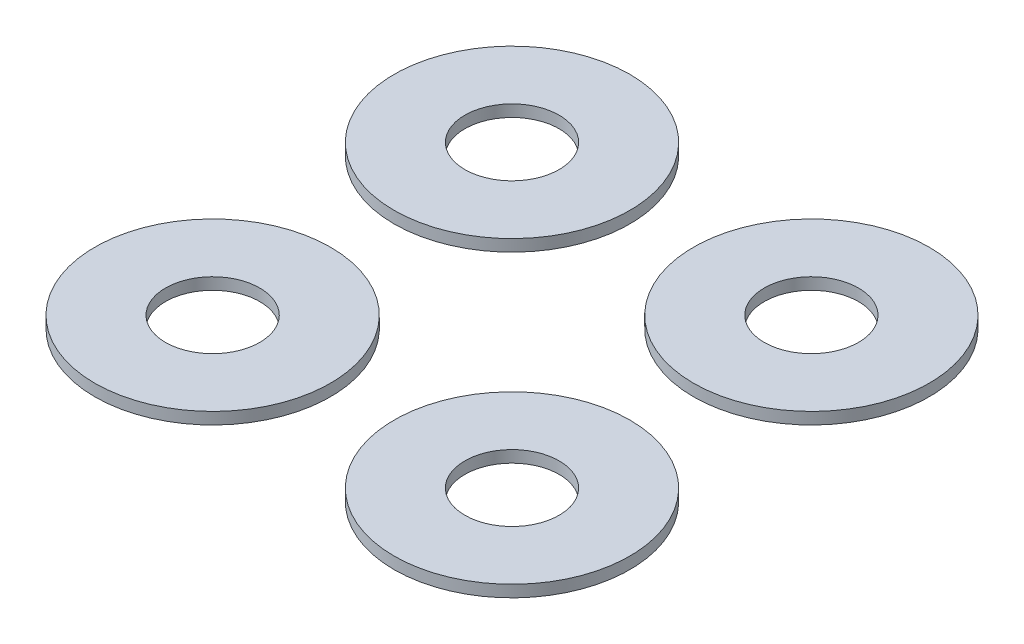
from build123d import *

# Parameters (mm, degrees)
SKETCH1_R             = 1
SKETCH1_R_2           = 0.4
BOSS_EXTRUDE1_DEPTH   = 0.1
BOSS_EXTRUDE1_2_DEPTH = 0.1
BOSS_EXTRUDE1_3_DEPTH = 0.1
BOSS_EXTRUDE1_4_DEPTH = 0.1


with BuildPart() as part:
    # Sketch1 → Boss-Extrude1 (new body)
    with BuildSketch(Plane(origin=(0, 0, 0), x_dir=(1, 0, 0), z_dir=(0, 1, 0))):
        with Locations(Location((0, 0, 0), (0, 0, 270))):
            Circle(SKETCH1_R)
        with Locations(Location((0, 0, 0), (0, 0, 270))):
            Circle(SKETCH1_R_2, mode=Mode.SUBTRACT)
    extrude(amount=BOSS_EXTRUDE1_DEPTH)


with BuildPart() as body_2:
    # Sketch1 → Boss-Extrude1 2 (new body)
    with BuildSketch(Plane(origin=(0, 0, 0), x_dir=(1, 0, 0), z_dir=(0, 1, 0))):
        with Locations(Location((0, 2.54, 0), (0, 0, 270))):
            Circle(SKETCH1_R)
        with Locations(Location((0, 2.54, 0), (0, 0, 270))):
            Circle(SKETCH1_R_2, mode=Mode.SUBTRACT)
    extrude(amount=BOSS_EXTRUDE1_2_DEPTH)


with BuildPart() as body_3:
    # Sketch1 → Boss-Extrude1 3 (new body)
    with BuildSketch(Plane(origin=(0, 0, 0), x_dir=(1, 0, 0), z_dir=(0, 1, 0))):
        with Locations(Location((2.54, 2.54, 0), (0, 0, 270))):
            Circle(SKETCH1_R)
        with Locations(Location((2.54, 2.54, 0), (0, 0, 270))):
            Circle(SKETCH1_R_2, mode=Mode.SUBTRACT)
    extrude(amount=BOSS_EXTRUDE1_3_DEPTH)


with BuildPart() as body_4:
    # Sketch1 → Boss-Extrude1 4 (new body)
    with BuildSketch(Plane(origin=(0, 0, 0), x_dir=(1, 0, 0), z_dir=(0, 1, 0))):
        with Locations(Location((2.54, 0, 0), (0, 0, 270))):
            Circle(SKETCH1_R)
        with Locations(Location((2.54, 0, 0), (0, 0, 270))):
            Circle(SKETCH1_R_2, mode=Mode.SUBTRACT)
    extrude(amount=BOSS_EXTRUDE1_4_DEPTH)


solid = Compound([part.part, body_2.part, body_3.part, body_4.part])
